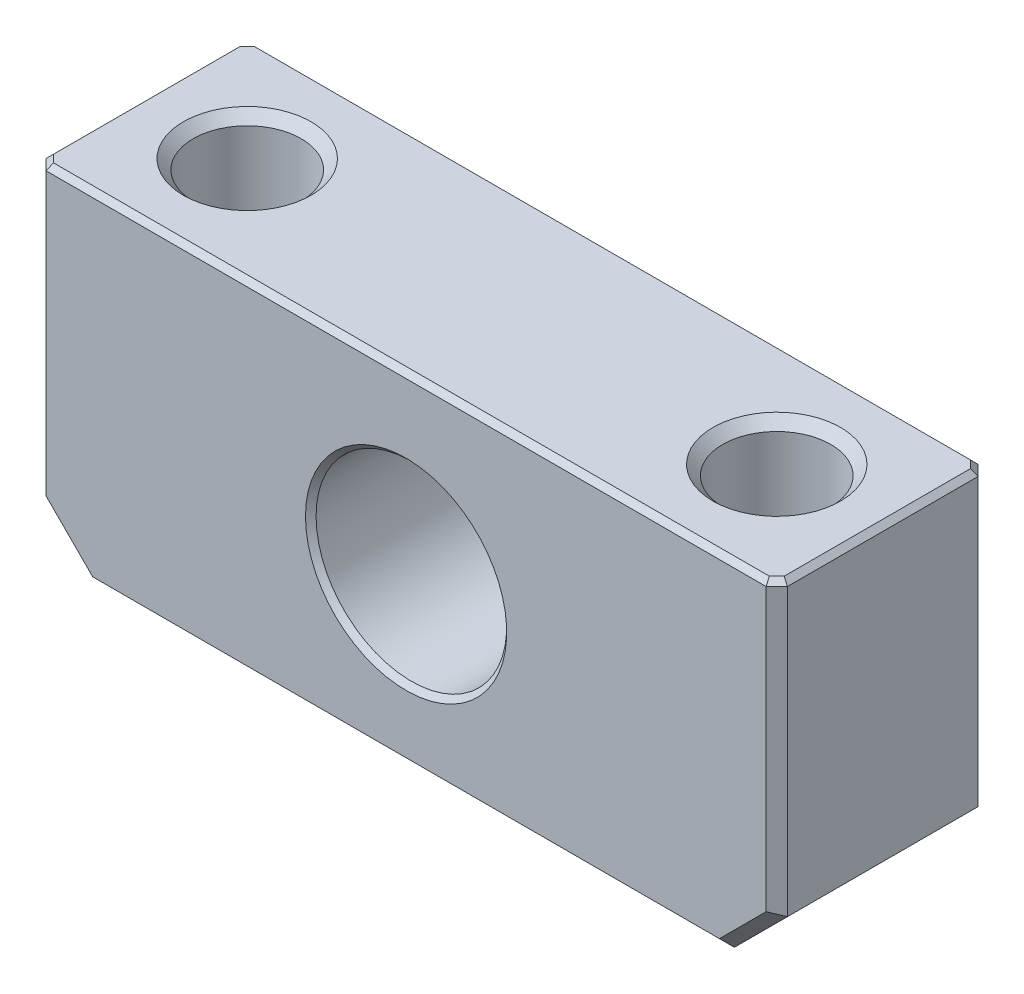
ISO-10303-21;
HEADER;
FILE_DESCRIPTION(('STEP AP214'),'2;1');
FILE_NAME('part.step','',(''),(''),'','','');
FILE_SCHEMA(('AUTOMOTIVE_DESIGN { 1 0 10303 214 1 1 1 1 }'));
ENDSEC;
DATA;
#1=APPLICATION_CONTEXT('core data for automotive mechanical design processes');
#2=APPLICATION_PROTOCOL_DEFINITION('international standard','automotive_design',2000,#1);
#3=PRODUCT_CONTEXT('',#1,'mechanical');
#4=PRODUCT('Part','Part','',(#3));
#5=PRODUCT_RELATED_PRODUCT_CATEGORY('part','',(#4));
#6=PRODUCT_DEFINITION_FORMATION('','',#4);
#7=PRODUCT_DEFINITION_CONTEXT('part definition',#1,'design');
#8=PRODUCT_DEFINITION('design','',#6,#7);
#9=PRODUCT_DEFINITION_SHAPE('','',#8);
#10=(LENGTH_UNIT() NAMED_UNIT(*) SI_UNIT(.MILLI.,.METRE.));
#11=(NAMED_UNIT(*) PLANE_ANGLE_UNIT() SI_UNIT($,.RADIAN.));
#12=(NAMED_UNIT(*) SI_UNIT($,.STERADIAN.) SOLID_ANGLE_UNIT());
#13=UNCERTAINTY_MEASURE_WITH_UNIT(LENGTH_MEASURE(1.E-05),#10,'distance_accuracy_value','');
#14=(GEOMETRIC_REPRESENTATION_CONTEXT(3) GLOBAL_UNCERTAINTY_ASSIGNED_CONTEXT((#13)) GLOBAL_UNIT_ASSIGNED_CONTEXT((#10,
#11,#12)) REPRESENTATION_CONTEXT('',''));
#15=CARTESIAN_POINT('',(0.,0.,0.));
#16=DIRECTION('',(0.,0.,1.));
#17=DIRECTION('',(1.,0.,0.));
#18=AXIS2_PLACEMENT_3D('',#15,#16,#17);
#19=CARTESIAN_POINT('',(-35.,16.5,-10.));
#20=DIRECTION('',(0.,1.,0.));
#21=DIRECTION('',(0.,0.,1.));
#22=AXIS2_PLACEMENT_3D('',#19,#20,#21);
#23=PLANE('',#22);
#24=DIRECTION('',(1.,0.,0.));
#25=VECTOR('',#24,1.);
#26=CARTESIAN_POINT('',(34.,16.5,9.5));
#27=LINE('',#26,#25);
#28=CARTESIAN_POINT('',(-33.7928932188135,16.5,9.5));
#29=VERTEX_POINT('',#28);
#30=CARTESIAN_POINT('',(33.7928932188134,16.5,9.5));
#31=VERTEX_POINT('',#30);
#32=EDGE_CURVE('E275',#29,#31,#27,.T.);
#33=ORIENTED_EDGE('',*,*,#32,.T.);
#34=DIRECTION('',(0.707106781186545,0.,-0.70710678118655));
#35=VECTOR('',#34,1.);
#36=CARTESIAN_POINT('',(9.14644660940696,16.5,34.1464466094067));
#37=LINE('',#36,#35);
#38=CARTESIAN_POINT('',(34.5,16.5,8.79289321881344));
#39=VERTEX_POINT('',#38);
#40=EDGE_CURVE('E289',#31,#39,#37,.T.);
#41=ORIENTED_EDGE('',*,*,#40,.T.);
#42=DIRECTION('',(0.,0.,-1.));
#43=VECTOR('',#42,1.);
#44=CARTESIAN_POINT('',(34.5,16.5,-10.));
#45=LINE('',#44,#43);
#46=CARTESIAN_POINT('',(34.5,16.5,-8.79289321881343));
#47=VERTEX_POINT('',#46);
#48=EDGE_CURVE('E287',#39,#47,#45,.T.);
#49=ORIENTED_EDGE('',*,*,#48,.T.);
#50=DIRECTION('',(-0.70710678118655,0.,-0.707106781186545));
#51=VECTOR('',#50,1.);
#52=CARTESIAN_POINT('',(-0.853553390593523,16.5,-44.1464466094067));
#53=LINE('',#52,#51);
#54=CARTESIAN_POINT('',(33.7928932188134,16.5,-9.5));
#55=VERTEX_POINT('',#54);
#56=EDGE_CURVE('E285',#47,#55,#53,.T.);
#57=ORIENTED_EDGE('',*,*,#56,.T.);
#58=DIRECTION('',(-1.,0.,0.));
#59=VECTOR('',#58,1.);
#60=CARTESIAN_POINT('',(-35.,16.5,-9.5));
#61=LINE('',#60,#59);
#62=CARTESIAN_POINT('',(-33.7928932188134,16.5,-9.5));
#63=VERTEX_POINT('',#62);
#64=EDGE_CURVE('E283',#55,#63,#61,.T.);
#65=ORIENTED_EDGE('',*,*,#64,.T.);
#66=DIRECTION('',(-0.70710678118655,0.,0.707106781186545));
#67=VECTOR('',#66,1.);
#68=CARTESIAN_POINT('',(-34.1464466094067,16.5,-9.14644660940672));
#69=LINE('',#68,#67);
#70=CARTESIAN_POINT('',(-34.5,16.5,-8.79289321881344));
#71=VERTEX_POINT('',#70);
#72=EDGE_CURVE('E281',#63,#71,#69,.T.);
#73=ORIENTED_EDGE('',*,*,#72,.T.);
#74=DIRECTION('',(0.,0.,1.));
#75=VECTOR('',#74,1.);
#76=CARTESIAN_POINT('',(-34.5,16.5,-10.));
#77=LINE('',#76,#75);
#78=CARTESIAN_POINT('',(-34.5,16.5,8.79289321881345));
#79=VERTEX_POINT('',#78);
#80=EDGE_CURVE('E279',#71,#79,#77,.T.);
#81=ORIENTED_EDGE('',*,*,#80,.T.);
#82=DIRECTION('',(0.707106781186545,0.,0.70710678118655));
#83=VECTOR('',#82,1.);
#84=CARTESIAN_POINT('',(-44.1464466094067,16.5,-0.853553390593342));
#85=LINE('',#84,#83);
#86=EDGE_CURVE('E277',#79,#29,#85,.T.);
#87=ORIENTED_EDGE('',*,*,#86,.T.);
#88=EDGE_LOOP('',(#33,#41,#49,#57,#65,#73,#81,#87));
#89=FACE_BOUND('',#88,.T.);
#90=CARTESIAN_POINT('',(-25.,16.5,0.));
#91=DIRECTION('',(0.,1.,0.));
#92=DIRECTION('',(0.,0.,1.));
#93=AXIS2_PLACEMENT_3D('',#90,#91,#92);
#94=CIRCLE('',#93,6.025);
#95=CARTESIAN_POINT('',(-25.,16.5,6.025));
#96=VERTEX_POINT('',#95);
#97=EDGE_CURVE('E171',#96,#96,#94,.T.);
#98=ORIENTED_EDGE('',*,*,#97,.F.);
#99=EDGE_LOOP('',(#98));
#100=FACE_BOUND('',#99,.T.);
#101=CARTESIAN_POINT('',(25.,16.5,0.));
#102=DIRECTION('',(0.,1.,0.));
#103=DIRECTION('',(0.,0.,1.));
#104=AXIS2_PLACEMENT_3D('',#101,#102,#103);
#105=CIRCLE('',#104,6.025);
#106=CARTESIAN_POINT('',(25.,16.5,6.025));
#107=VERTEX_POINT('',#106);
#108=EDGE_CURVE('E164',#107,#107,#105,.T.);
#109=ORIENTED_EDGE('',*,*,#108,.F.);
#110=EDGE_LOOP('',(#109));
#111=FACE_BOUND('',#110,.T.);
#112=ADVANCED_FACE('F36',(#89,#100,#111),#23,.T.);
#113=CARTESIAN_POINT('',(35.,16.5,-10.));
#114=DIRECTION('',(1.,0.,0.));
#115=DIRECTION('',(0.,0.,-1.));
#116=AXIS2_PLACEMENT_3D('',#113,#114,#115);
#117=PLANE('',#116);
#118=DIRECTION('',(0.,1.,0.));
#119=VECTOR('',#118,1.);
#120=CARTESIAN_POINT('',(35.,16.5,-8.99999999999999));
#121=LINE('',#120,#119);
#122=CARTESIAN_POINT('',(35.,-11.,-8.99999999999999));
#123=VERTEX_POINT('',#122);
#124=CARTESIAN_POINT('',(35.,16.,-8.99999999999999));
#125=VERTEX_POINT('',#124);
#126=EDGE_CURVE('E203',#123,#125,#121,.T.);
#127=ORIENTED_EDGE('',*,*,#126,.T.);
#128=DIRECTION('',(0.,0.,1.));
#129=VECTOR('',#128,1.);
#130=CARTESIAN_POINT('',(35.,16.,-10.));
#131=LINE('',#130,#129);
#132=CARTESIAN_POINT('',(35.,16.,8.99999999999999));
#133=VERTEX_POINT('',#132);
#134=EDGE_CURVE('E295',#125,#133,#131,.T.);
#135=ORIENTED_EDGE('',*,*,#134,.T.);
#136=DIRECTION('',(0.,-1.,0.));
#137=VECTOR('',#136,1.);
#138=CARTESIAN_POINT('',(35.,-11.,8.99999999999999));
#139=LINE('',#138,#137);
#140=CARTESIAN_POINT('',(35.,-11.,8.99999999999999));
#141=VERTEX_POINT('',#140);
#142=EDGE_CURVE('E206',#133,#141,#139,.T.);
#143=ORIENTED_EDGE('',*,*,#142,.T.);
#144=DIRECTION('',(0.,0.,-1.));
#145=VECTOR('',#144,1.);
#146=CARTESIAN_POINT('',(35.,-11.,-10.));
#147=LINE('',#146,#145);
#148=EDGE_CURVE('E189',#141,#123,#147,.T.);
#149=ORIENTED_EDGE('',*,*,#148,.T.);
#150=EDGE_LOOP('',(#127,#135,#143,#149));
#151=FACE_BOUND('',#150,.T.);
#152=ADVANCED_FACE('F395',(#151),#117,.T.);
#153=CARTESIAN_POINT('',(-35.,-16.,-10.));
#154=DIRECTION('',(0.,-1.,0.));
#155=DIRECTION('',(0.,0.,-1.));
#156=AXIS2_PLACEMENT_3D('',#153,#154,#155);
#157=PLANE('',#156);
#158=DIRECTION('',(0.,0.,1.));
#159=VECTOR('',#158,1.);
#160=CARTESIAN_POINT('',(30.,-16.,-10.));
#161=LINE('',#160,#159);
#162=CARTESIAN_POINT('',(30.,-16.,-8.99999999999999));
#163=VERTEX_POINT('',#162);
#164=CARTESIAN_POINT('',(30.,-16.,8.99999999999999));
#165=VERTEX_POINT('',#164);
#166=EDGE_CURVE('E183',#163,#165,#161,.T.);
#167=ORIENTED_EDGE('',*,*,#166,.T.);
#168=DIRECTION('',(-1.,0.,0.));
#169=VECTOR('',#168,1.);
#170=CARTESIAN_POINT('',(-30.,-16.,8.99999999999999));
#171=LINE('',#170,#169);
#172=CARTESIAN_POINT('',(-30.,-16.,8.99999999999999));
#173=VERTEX_POINT('',#172);
#174=EDGE_CURVE('E214',#165,#173,#171,.T.);
#175=ORIENTED_EDGE('',*,*,#174,.T.);
#176=DIRECTION('',(0.,0.,-1.));
#177=VECTOR('',#176,1.);
#178=CARTESIAN_POINT('',(-30.,-16.,-10.));
#179=LINE('',#178,#177);
#180=CARTESIAN_POINT('',(-30.,-16.,-8.99999999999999));
#181=VERTEX_POINT('',#180);
#182=EDGE_CURVE('E186',#173,#181,#179,.T.);
#183=ORIENTED_EDGE('',*,*,#182,.T.);
#184=DIRECTION('',(1.,0.,0.));
#185=VECTOR('',#184,1.);
#186=CARTESIAN_POINT('',(-35.,-16.,-8.99999999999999));
#187=LINE('',#186,#185);
#188=EDGE_CURVE('E212',#181,#163,#187,.T.);
#189=ORIENTED_EDGE('',*,*,#188,.T.);
#190=EDGE_LOOP('',(#167,#175,#183,#189));
#191=FACE_BOUND('',#190,.T.);
#192=ADVANCED_FACE('F352',(#191),#157,.T.);
#193=CARTESIAN_POINT('',(-35.,-16.,-10.));
#194=DIRECTION('',(-1.,0.,0.));
#195=DIRECTION('',(0.,0.,1.));
#196=AXIS2_PLACEMENT_3D('',#193,#194,#195);
#197=PLANE('',#196);
#198=DIRECTION('',(0.,1.,0.));
#199=VECTOR('',#198,1.);
#200=CARTESIAN_POINT('',(-35.,16.5,8.99999999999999));
#201=LINE('',#200,#199);
#202=CARTESIAN_POINT('',(-35.,-11.,8.99999999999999));
#203=VERTEX_POINT('',#202);
#204=CARTESIAN_POINT('',(-35.,16.,8.99999999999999));
#205=VERTEX_POINT('',#204);
#206=EDGE_CURVE('E222',#203,#205,#201,.T.);
#207=ORIENTED_EDGE('',*,*,#206,.T.);
#208=DIRECTION('',(0.,0.,-1.));
#209=VECTOR('',#208,1.);
#210=CARTESIAN_POINT('',(-35.,16.,-10.));
#211=LINE('',#210,#209);
#212=CARTESIAN_POINT('',(-35.,16.,-8.99999999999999));
#213=VERTEX_POINT('',#212);
#214=EDGE_CURVE('E45',#205,#213,#211,.T.);
#215=ORIENTED_EDGE('',*,*,#214,.T.);
#216=DIRECTION('',(0.,-1.,0.));
#217=VECTOR('',#216,1.);
#218=CARTESIAN_POINT('',(-35.,-16.,-8.99999999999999));
#219=LINE('',#218,#217);
#220=CARTESIAN_POINT('',(-35.,-11.,-8.99999999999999));
#221=VERTEX_POINT('',#220);
#222=EDGE_CURVE('E220',#213,#221,#219,.T.);
#223=ORIENTED_EDGE('',*,*,#222,.T.);
#224=DIRECTION('',(0.,0.,1.));
#225=VECTOR('',#224,1.);
#226=CARTESIAN_POINT('',(-35.,-11.,-10.));
#227=LINE('',#226,#225);
#228=EDGE_CURVE('E180',#221,#203,#227,.T.);
#229=ORIENTED_EDGE('',*,*,#228,.T.);
#230=EDGE_LOOP('',(#207,#215,#223,#229));
#231=FACE_BOUND('',#230,.T.);
#232=ADVANCED_FACE('F385',(#231),#197,.T.);
#233=CARTESIAN_POINT('',(35.,16.5,-10.));
#234=DIRECTION('',(0.,0.,-1.));
#235=DIRECTION('',(-1.,0.,0.));
#236=AXIS2_PLACEMENT_3D('',#233,#234,#235);
#237=PLANE('',#236);
#238=CARTESIAN_POINT('',(0.,0.,-10.));
#239=DIRECTION('',(0.,0.,-1.));
#240=DIRECTION('',(-1.,0.,0.));
#241=AXIS2_PLACEMENT_3D('',#238,#239,#240);
#242=CIRCLE('',#241,9.49999999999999);
#243=CARTESIAN_POINT('',(-9.49999999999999,0.,-10.));
#244=VERTEX_POINT('',#243);
#245=EDGE_CURVE('E272',#244,#244,#242,.F.);
#246=ORIENTED_EDGE('',*,*,#245,.T.);
#247=EDGE_LOOP('',(#246));
#248=FACE_BOUND('',#247,.T.);
#249=DIRECTION('',(0.,1.,0.));
#250=VECTOR('',#249,1.);
#251=CARTESIAN_POINT('',(-34.,16.5,-10.));
#252=LINE('',#251,#250);
#253=CARTESIAN_POINT('',(-34.,-10.5857864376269,-10.));
#254=VERTEX_POINT('',#253);
#255=CARTESIAN_POINT('',(-34.,16.,-10.));
#256=VERTEX_POINT('',#255);
#257=EDGE_CURVE('E224',#254,#256,#252,.T.);
#258=ORIENTED_EDGE('',*,*,#257,.T.);
#259=DIRECTION('',(1.,0.,0.));
#260=VECTOR('',#259,1.);
#261=CARTESIAN_POINT('',(35.,16.,-10.));
#262=LINE('',#261,#260);
#263=CARTESIAN_POINT('',(34.,16.,-10.));
#264=VERTEX_POINT('',#263);
#265=EDGE_CURVE('E270',#256,#264,#262,.T.);
#266=ORIENTED_EDGE('',*,*,#265,.T.);
#267=DIRECTION('',(0.,-1.,0.));
#268=VECTOR('',#267,1.);
#269=CARTESIAN_POINT('',(34.,16.5,-10.));
#270=LINE('',#269,#268);
#271=CARTESIAN_POINT('',(34.,-10.5857864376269,-10.));
#272=VERTEX_POINT('',#271);
#273=EDGE_CURVE('E233',#264,#272,#270,.T.);
#274=ORIENTED_EDGE('',*,*,#273,.T.);
#275=DIRECTION('',(-0.707106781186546,-0.707106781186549,0.));
#276=VECTOR('',#275,1.);
#277=CARTESIAN_POINT('',(48.0428932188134,3.45710678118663,-10.));
#278=LINE('',#277,#276);
#279=CARTESIAN_POINT('',(29.5857864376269,-15.,-10.));
#280=VERTEX_POINT('',#279);
#281=EDGE_CURVE('E231',#272,#280,#278,.T.);
#282=ORIENTED_EDGE('',*,*,#281,.T.);
#283=DIRECTION('',(-1.,0.,0.));
#284=VECTOR('',#283,1.);
#285=CARTESIAN_POINT('',(35.,-15.,-10.));
#286=LINE('',#285,#284);
#287=CARTESIAN_POINT('',(-29.5857864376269,-15.,-10.));
#288=VERTEX_POINT('',#287);
#289=EDGE_CURVE('E229',#280,#288,#286,.T.);
#290=ORIENTED_EDGE('',*,*,#289,.T.);
#291=DIRECTION('',(-0.707106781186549,0.707106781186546,0.));
#292=VECTOR('',#291,1.);
#293=CARTESIAN_POINT('',(-13.0428932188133,-31.5428932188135,-10.));
#294=LINE('',#293,#292);
#295=EDGE_CURVE('E227',#288,#254,#294,.T.);
#296=ORIENTED_EDGE('',*,*,#295,.T.);
#297=EDGE_LOOP('',(#258,#266,#274,#282,#290,#296));
#298=FACE_BOUND('',#297,.T.);
#299=ADVANCED_FACE('F337',(#248,#298),#237,.T.);
#300=CARTESIAN_POINT('',(0.,0.,-10.));
#301=DIRECTION('',(0.,0.,1.));
#302=DIRECTION('',(1.,0.,0.));
#303=AXIS2_PLACEMENT_3D('',#300,#301,#302);
#304=CYLINDRICAL_SURFACE('',#303,9.);
#305=CARTESIAN_POINT('',(0.,0.,9.5));
#306=DIRECTION('',(0.,0.,-1.));
#307=DIRECTION('',(-1.,0.,0.));
#308=AXIS2_PLACEMENT_3D('',#305,#306,#307);
#309=CIRCLE('',#308,9.);
#310=CARTESIAN_POINT('',(-9.,0.,9.5));
#311=VERTEX_POINT('',#310);
#312=EDGE_CURVE('E262',#311,#311,#309,.F.);
#313=ORIENTED_EDGE('',*,*,#312,.T.);
#314=EDGE_LOOP('',(#313));
#315=FACE_BOUND('',#314,.T.);
#316=CARTESIAN_POINT('',(0.,0.,-9.49999999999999));
#317=DIRECTION('',(0.,0.,-1.));
#318=DIRECTION('',(-1.,0.,0.));
#319=AXIS2_PLACEMENT_3D('',#316,#317,#318);
#320=CIRCLE('',#319,9.);
#321=CARTESIAN_POINT('',(-9.,0.,-9.49999999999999));
#322=VERTEX_POINT('',#321);
#323=EDGE_CURVE('E235',#322,#322,#320,.T.);
#324=ORIENTED_EDGE('',*,*,#323,.T.);
#325=EDGE_LOOP('',(#324));
#326=FACE_BOUND('',#325,.T.);
#327=ADVANCED_FACE('F392',(#315,#326),#304,.F.);
#328=CARTESIAN_POINT('',(35.,16.5,10.));
#329=DIRECTION('',(0.,0.,-1.));
#330=DIRECTION('',(-1.,0.,0.));
#331=AXIS2_PLACEMENT_3D('',#328,#329,#330);
#332=PLANE('',#331);
#333=CARTESIAN_POINT('',(0.,0.,10.));
#334=DIRECTION('',(0.,0.,-1.));
#335=DIRECTION('',(-1.,0.,0.));
#336=AXIS2_PLACEMENT_3D('',#333,#334,#335);
#337=CIRCLE('',#336,9.49999999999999);
#338=CARTESIAN_POINT('',(-9.49999999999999,0.,10.));
#339=VERTEX_POINT('',#338);
#340=EDGE_CURVE('E267',#339,#339,#337,.T.);
#341=ORIENTED_EDGE('',*,*,#340,.T.);
#342=EDGE_LOOP('',(#341));
#343=FACE_BOUND('',#342,.T.);
#344=DIRECTION('',(0.,1.,0.));
#345=VECTOR('',#344,1.);
#346=CARTESIAN_POINT('',(34.,16.5,10.));
#347=LINE('',#346,#345);
#348=CARTESIAN_POINT('',(34.,-10.5857864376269,10.));
#349=VERTEX_POINT('',#348);
#350=CARTESIAN_POINT('',(34.,16.,10.));
#351=VERTEX_POINT('',#350);
#352=EDGE_CURVE('E200',#349,#351,#347,.T.);
#353=ORIENTED_EDGE('',*,*,#352,.T.);
#354=DIRECTION('',(-1.,0.,0.));
#355=VECTOR('',#354,1.);
#356=CARTESIAN_POINT('',(-34.,16.,10.));
#357=LINE('',#356,#355);
#358=CARTESIAN_POINT('',(-34.,16.,10.));
#359=VERTEX_POINT('',#358);
#360=EDGE_CURVE('E265',#351,#359,#357,.T.);
#361=ORIENTED_EDGE('',*,*,#360,.T.);
#362=DIRECTION('',(0.,-1.,0.));
#363=VECTOR('',#362,1.);
#364=CARTESIAN_POINT('',(-34.,-11.,10.));
#365=LINE('',#364,#363);
#366=CARTESIAN_POINT('',(-34.,-10.5857864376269,10.));
#367=VERTEX_POINT('',#366);
#368=EDGE_CURVE('E192',#359,#367,#365,.T.);
#369=ORIENTED_EDGE('',*,*,#368,.T.);
#370=DIRECTION('',(0.707106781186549,-0.707106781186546,0.));
#371=VECTOR('',#370,1.);
#372=CARTESIAN_POINT('',(-29.2928932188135,-15.2928932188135,10.));
#373=LINE('',#372,#371);
#374=CARTESIAN_POINT('',(-29.5857864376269,-15.,10.));
#375=VERTEX_POINT('',#374);
#376=EDGE_CURVE('E194',#367,#375,#373,.T.);
#377=ORIENTED_EDGE('',*,*,#376,.T.);
#378=DIRECTION('',(1.,0.,0.));
#379=VECTOR('',#378,1.);
#380=CARTESIAN_POINT('',(30.,-15.,10.));
#381=LINE('',#380,#379);
#382=CARTESIAN_POINT('',(29.5857864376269,-15.,10.));
#383=VERTEX_POINT('',#382);
#384=EDGE_CURVE('E196',#375,#383,#381,.T.);
#385=ORIENTED_EDGE('',*,*,#384,.T.);
#386=DIRECTION('',(0.707106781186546,0.707106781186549,0.));
#387=VECTOR('',#386,1.);
#388=CARTESIAN_POINT('',(34.2928932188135,-10.2928932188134,10.));
#389=LINE('',#388,#387);
#390=EDGE_CURVE('E198',#383,#349,#389,.T.);
#391=ORIENTED_EDGE('',*,*,#390,.T.);
#392=EDGE_LOOP('',(#353,#361,#369,#377,#385,#391));
#393=FACE_BOUND('',#392,.T.);
#394=ADVANCED_FACE('F370',(#343,#393),#332,.F.);
#395=CARTESIAN_POINT('',(25.,-10.5,0.));
#396=DIRECTION('',(0.,1.,0.));
#397=DIRECTION('',(0.,0.,1.));
#398=AXIS2_PLACEMENT_3D('',#395,#396,#397);
#399=CONICAL_SURFACE('',#398,5.09999999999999,1.02974425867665);
#400=CARTESIAN_POINT('',(25.,-13.5643891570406,0.));
#401=VERTEX_POINT('',#400);
#402=VERTEX_LOOP('',#401);
#403=FACE_BOUND('',#402,.T.);
#404=CARTESIAN_POINT('',(25.,-10.5,0.));
#405=DIRECTION('',(0.,1.,0.));
#406=DIRECTION('',(0.,0.,1.));
#407=AXIS2_PLACEMENT_3D('',#404,#405,#406);
#408=CIRCLE('',#407,5.09999999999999);
#409=CARTESIAN_POINT('',(25.,-10.5,5.09999999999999));
#410=VERTEX_POINT('',#409);
#411=EDGE_CURVE('E177',#410,#410,#408,.T.);
#412=ORIENTED_EDGE('',*,*,#411,.T.);
#413=EDGE_LOOP('',(#412));
#414=FACE_BOUND('',#413,.T.);
#415=ADVANCED_FACE('F563',(#403,#414),#399,.F.);
#416=CARTESIAN_POINT('',(25.,16.5,0.));
#417=DIRECTION('',(0.,1.,0.));
#418=DIRECTION('',(0.,0.,1.));
#419=AXIS2_PLACEMENT_3D('',#416,#417,#418);
#420=CYLINDRICAL_SURFACE('',#419,5.1);
#421=ORIENTED_EDGE('',*,*,#411,.F.);
#422=EDGE_LOOP('',(#421));
#423=FACE_BOUND('',#422,.T.);
#424=CARTESIAN_POINT('',(25.,15.575,0.));
#425=DIRECTION('',(0.,1.,0.));
#426=DIRECTION('',(0.,0.,1.));
#427=AXIS2_PLACEMENT_3D('',#424,#425,#426);
#428=CIRCLE('',#427,5.1);
#429=CARTESIAN_POINT('',(25.,15.575,5.1));
#430=VERTEX_POINT('',#429);
#431=EDGE_CURVE('E168',#430,#430,#428,.T.);
#432=ORIENTED_EDGE('',*,*,#431,.T.);
#433=EDGE_LOOP('',(#432));
#434=FACE_BOUND('',#433,.T.);
#435=ADVANCED_FACE('F555',(#423,#434),#420,.F.);
#436=CARTESIAN_POINT('',(25.,16.5,0.));
#437=DIRECTION('',(0.,1.,0.));
#438=DIRECTION('',(0.,0.,1.));
#439=AXIS2_PLACEMENT_3D('',#436,#437,#438);
#440=CONICAL_SURFACE('',#439,6.025,0.785398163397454);
#441=ORIENTED_EDGE('',*,*,#431,.F.);
#442=EDGE_LOOP('',(#441));
#443=FACE_BOUND('',#442,.T.);
#444=ORIENTED_EDGE('',*,*,#108,.T.);
#445=EDGE_LOOP('',(#444));
#446=FACE_BOUND('',#445,.T.);
#447=ADVANCED_FACE('F158',(#443,#446),#440,.F.);
#448=CARTESIAN_POINT('',(-25.,-10.5,0.));
#449=DIRECTION('',(0.,1.,0.));
#450=DIRECTION('',(0.,0.,1.));
#451=AXIS2_PLACEMENT_3D('',#448,#449,#450);
#452=CONICAL_SURFACE('',#451,5.09999999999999,1.02974425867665);
#453=CARTESIAN_POINT('',(-25.,-13.5643891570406,0.));
#454=VERTEX_POINT('',#453);
#455=VERTEX_LOOP('',#454);
#456=FACE_BOUND('',#455,.T.);
#457=CARTESIAN_POINT('',(-25.,-10.5,0.));
#458=DIRECTION('',(0.,1.,0.));
#459=DIRECTION('',(0.,0.,1.));
#460=AXIS2_PLACEMENT_3D('',#457,#458,#459);
#461=CIRCLE('',#460,5.09999999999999);
#462=CARTESIAN_POINT('',(-25.,-10.5,5.09999999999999));
#463=VERTEX_POINT('',#462);
#464=EDGE_CURVE('E162',#463,#463,#461,.T.);
#465=ORIENTED_EDGE('',*,*,#464,.T.);
#466=EDGE_LOOP('',(#465));
#467=FACE_BOUND('',#466,.T.);
#468=ADVANCED_FACE('F154',(#456,#467),#452,.F.);
#469=CARTESIAN_POINT('',(-25.,16.5,0.));
#470=DIRECTION('',(0.,1.,0.));
#471=DIRECTION('',(0.,0.,1.));
#472=AXIS2_PLACEMENT_3D('',#469,#470,#471);
#473=CYLINDRICAL_SURFACE('',#472,5.1);
#474=ORIENTED_EDGE('',*,*,#464,.F.);
#475=EDGE_LOOP('',(#474));
#476=FACE_BOUND('',#475,.T.);
#477=CARTESIAN_POINT('',(-25.,15.575,0.));
#478=DIRECTION('',(0.,1.,0.));
#479=DIRECTION('',(0.,0.,1.));
#480=AXIS2_PLACEMENT_3D('',#477,#478,#479);
#481=CIRCLE('',#480,5.1);
#482=CARTESIAN_POINT('',(-25.,15.575,5.1));
#483=VERTEX_POINT('',#482);
#484=EDGE_CURVE('E165',#483,#483,#481,.T.);
#485=ORIENTED_EDGE('',*,*,#484,.T.);
#486=EDGE_LOOP('',(#485));
#487=FACE_BOUND('',#486,.T.);
#488=ADVANCED_FACE('F157',(#476,#487),#473,.F.);
#489=CARTESIAN_POINT('',(-25.,16.5,0.));
#490=DIRECTION('',(0.,1.,0.));
#491=DIRECTION('',(0.,0.,1.));
#492=AXIS2_PLACEMENT_3D('',#489,#490,#491);
#493=CONICAL_SURFACE('',#492,6.025,0.785398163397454);
#494=ORIENTED_EDGE('',*,*,#484,.F.);
#495=EDGE_LOOP('',(#494));
#496=FACE_BOUND('',#495,.T.);
#497=ORIENTED_EDGE('',*,*,#97,.T.);
#498=EDGE_LOOP('',(#497));
#499=FACE_BOUND('',#498,.T.);
#500=ADVANCED_FACE('F409',(#496,#499),#493,.F.);
#501=CARTESIAN_POINT('',(-35.,-11.,-10.));
#502=DIRECTION('',(0.707106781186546,0.707106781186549,0.));
#503=DIRECTION('',(-0.707106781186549,0.707106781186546,0.));
#504=AXIS2_PLACEMENT_3D('',#501,#502,#503);
#505=PLANE('',#504);
#506=ORIENTED_EDGE('',*,*,#182,.F.);
#507=DIRECTION('',(0.707106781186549,-0.707106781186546,0.));
#508=VECTOR('',#507,1.);
#509=CARTESIAN_POINT('',(-35.,-11.,8.99999999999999));
#510=LINE('',#509,#508);
#511=EDGE_CURVE('E218',#173,#203,#510,.F.);
#512=ORIENTED_EDGE('',*,*,#511,.T.);
#513=ORIENTED_EDGE('',*,*,#228,.F.);
#514=DIRECTION('',(-0.707106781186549,0.707106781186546,0.));
#515=VECTOR('',#514,1.);
#516=CARTESIAN_POINT('',(-35.,-11.,-8.99999999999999));
#517=LINE('',#516,#515);
#518=EDGE_CURVE('E216',#221,#181,#517,.F.);
#519=ORIENTED_EDGE('',*,*,#518,.T.);
#520=EDGE_LOOP('',(#506,#512,#513,#519));
#521=FACE_BOUND('',#520,.T.);
#522=ADVANCED_FACE('F379',(#521),#505,.F.);
#523=CARTESIAN_POINT('',(30.,-16.,-10.));
#524=DIRECTION('',(-0.707106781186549,0.707106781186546,0.));
#525=DIRECTION('',(-0.707106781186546,-0.707106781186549,0.));
#526=AXIS2_PLACEMENT_3D('',#523,#524,#525);
#527=PLANE('',#526);
#528=ORIENTED_EDGE('',*,*,#148,.F.);
#529=DIRECTION('',(0.707106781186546,0.707106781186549,0.));
#530=VECTOR('',#529,1.);
#531=CARTESIAN_POINT('',(30.,-16.,8.99999999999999));
#532=LINE('',#531,#530);
#533=EDGE_CURVE('E210',#141,#165,#532,.F.);
#534=ORIENTED_EDGE('',*,*,#533,.T.);
#535=ORIENTED_EDGE('',*,*,#166,.F.);
#536=DIRECTION('',(-0.707106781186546,-0.707106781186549,0.));
#537=VECTOR('',#536,1.);
#538=CARTESIAN_POINT('',(30.,-16.,-8.99999999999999));
#539=LINE('',#538,#537);
#540=EDGE_CURVE('E208',#163,#123,#539,.F.);
#541=ORIENTED_EDGE('',*,*,#540,.T.);
#542=EDGE_LOOP('',(#528,#534,#535,#541));
#543=FACE_BOUND('',#542,.T.);
#544=ADVANCED_FACE('F357',(#543),#527,.F.);
#545=CARTESIAN_POINT('',(-34.,16.5,10.));
#546=DIRECTION('',(-0.70710678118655,0.,0.707106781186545));
#547=DIRECTION('',(0.707106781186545,0.,0.70710678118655));
#548=AXIS2_PLACEMENT_3D('',#545,#546,#547);
#549=PLANE('',#548);
#550=ORIENTED_EDGE('',*,*,#368,.F.);
#551=DIRECTION('',(-0.707106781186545,0.,-0.70710678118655));
#552=VECTOR('',#551,1.);
#553=CARTESIAN_POINT('',(-34.,16.,10.));
#554=LINE('',#553,#552);
#555=EDGE_CURVE('E11',#359,#205,#554,.T.);
#556=ORIENTED_EDGE('',*,*,#555,.T.);
#557=ORIENTED_EDGE('',*,*,#206,.F.);
#558=DIRECTION('',(-0.678598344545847,-0.281084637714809,-0.678598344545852));
#559=VECTOR('',#558,1.);
#560=CARTESIAN_POINT('',(-28.8335604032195,-8.44577708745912,15.1664395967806));
#561=LINE('',#560,#559);
#562=EDGE_CURVE('E246',#367,#203,#561,.T.);
#563=ORIENTED_EDGE('',*,*,#562,.F.);
#564=EDGE_LOOP('',(#550,#556,#557,#563));
#565=FACE_BOUND('',#564,.T.);
#566=ADVANCED_FACE('F384',(#565),#549,.T.);
#567=CARTESIAN_POINT('',(-13.0428932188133,-31.5428932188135,10.));
#568=DIRECTION('',(0.500000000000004,0.500000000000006,-0.707106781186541));
#569=DIRECTION('',(0.,0.81649658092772,0.577350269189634));
#570=AXIS2_PLACEMENT_3D('',#567,#568,#569);
#571=PLANE('',#570);
#572=ORIENTED_EDGE('',*,*,#562,.T.);
#573=ORIENTED_EDGE('',*,*,#511,.F.);
#574=DIRECTION('',(-0.281084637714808,-0.678598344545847,-0.678598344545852));
#575=VECTOR('',#574,1.);
#576=CARTESIAN_POINT('',(-31.4342065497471,-19.462480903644,5.53751909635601));
#577=LINE('',#576,#575);
#578=EDGE_CURVE('E243',#375,#173,#577,.T.);
#579=ORIENTED_EDGE('',*,*,#578,.F.);
#580=ORIENTED_EDGE('',*,*,#376,.F.);
#581=EDGE_LOOP('',(#572,#573,#579,#580));
#582=FACE_BOUND('',#581,.T.);
#583=ADVANCED_FACE('F382',(#582),#571,.F.);
#584=CARTESIAN_POINT('',(35.,-15.,10.));
#585=DIRECTION('',(0.,-0.70710678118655,0.707106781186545));
#586=DIRECTION('',(0.,-0.707106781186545,-0.70710678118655));
#587=AXIS2_PLACEMENT_3D('',#584,#585,#586);
#588=PLANE('',#587);
#589=ORIENTED_EDGE('',*,*,#578,.T.);
#590=ORIENTED_EDGE('',*,*,#174,.F.);
#591=DIRECTION('',(0.281084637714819,-0.678598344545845,-0.67859834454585));
#592=VECTOR('',#591,1.);
#593=CARTESIAN_POINT('',(30.0135557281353,-16.032726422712,8.967273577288));
#594=LINE('',#593,#592);
#595=EDGE_CURVE('E239',#383,#165,#594,.T.);
#596=ORIENTED_EDGE('',*,*,#595,.F.);
#597=ORIENTED_EDGE('',*,*,#384,.F.);
#598=EDGE_LOOP('',(#589,#590,#596,#597));
#599=FACE_BOUND('',#598,.T.);
#600=ADVANCED_FACE('F376',(#599),#588,.T.);
#601=CARTESIAN_POINT('',(48.0428932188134,3.45710678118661,10.));
#602=DIRECTION('',(-0.500000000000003,0.500000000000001,-0.707106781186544));
#603=DIRECTION('',(-0.816496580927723,0.,0.57735026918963));
#604=AXIS2_PLACEMENT_3D('',#601,#602,#603);
#605=PLANE('',#604);
#606=ORIENTED_EDGE('',*,*,#595,.T.);
#607=ORIENTED_EDGE('',*,*,#533,.F.);
#608=DIRECTION('',(0.678598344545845,-0.281084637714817,-0.67859834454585));
#609=VECTOR('',#608,1.);
#610=CARTESIAN_POINT('',(37.7881005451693,-12.1548690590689,6.21189945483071));
#611=LINE('',#610,#609);
#612=EDGE_CURVE('E236',#349,#141,#611,.T.);
#613=ORIENTED_EDGE('',*,*,#612,.F.);
#614=ORIENTED_EDGE('',*,*,#390,.F.);
#615=EDGE_LOOP('',(#606,#607,#613,#614));
#616=FACE_BOUND('',#615,.T.);
#617=ADVANCED_FACE('F361',(#616),#605,.F.);
#618=CARTESIAN_POINT('',(34.,16.5,10.));
#619=DIRECTION('',(0.70710678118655,0.,0.707106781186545));
#620=DIRECTION('',(0.707106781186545,0.,-0.70710678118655));
#621=AXIS2_PLACEMENT_3D('',#618,#619,#620);
#622=PLANE('',#621);
#623=ORIENTED_EDGE('',*,*,#142,.F.);
#624=DIRECTION('',(-0.707106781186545,0.,0.70710678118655));
#625=VECTOR('',#624,1.);
#626=CARTESIAN_POINT('',(34.,16.,10.));
#627=LINE('',#626,#625);
#628=EDGE_CURVE('E292',#133,#351,#627,.T.);
#629=ORIENTED_EDGE('',*,*,#628,.T.);
#630=ORIENTED_EDGE('',*,*,#352,.F.);
#631=ORIENTED_EDGE('',*,*,#612,.T.);
#632=EDGE_LOOP('',(#623,#629,#630,#631));
#633=FACE_BOUND('',#632,.T.);
#634=ADVANCED_FACE('F367',(#633),#622,.T.);
#635=CARTESIAN_POINT('',(-35.,-16.,-8.99999999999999));
#636=DIRECTION('',(0.707106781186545,0.,0.70710678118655));
#637=DIRECTION('',(0.70710678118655,0.,-0.707106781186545));
#638=AXIS2_PLACEMENT_3D('',#635,#636,#637);
#639=PLANE('',#638);
#640=ORIENTED_EDGE('',*,*,#222,.F.);
#641=DIRECTION('',(-0.70710678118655,0.,0.707106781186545));
#642=VECTOR('',#641,1.);
#643=CARTESIAN_POINT('',(-35.,16.,-8.99999999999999));
#644=LINE('',#643,#642);
#645=EDGE_CURVE('E299',#213,#256,#644,.F.);
#646=ORIENTED_EDGE('',*,*,#645,.T.);
#647=ORIENTED_EDGE('',*,*,#257,.F.);
#648=DIRECTION('',(0.678598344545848,0.281084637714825,-0.678598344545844));
#649=VECTOR('',#648,1.);
#650=CARTESIAN_POINT('',(-35.9537178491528,-11.3950428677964,-8.04628215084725));
#651=LINE('',#650,#649);
#652=EDGE_CURVE('E240',#221,#254,#651,.T.);
#653=ORIENTED_EDGE('',*,*,#652,.F.);
#654=EDGE_LOOP('',(#640,#646,#647,#653));
#655=FACE_BOUND('',#654,.T.);
#656=ADVANCED_FACE('F334',(#655),#639,.F.);
#657=CARTESIAN_POINT('',(-13.0428932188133,-31.5428932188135,-10.));
#658=DIRECTION('',(-0.499999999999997,-0.499999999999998,-0.707106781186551));
#659=DIRECTION('',(0.,0.816496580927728,-0.577350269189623));
#660=AXIS2_PLACEMENT_3D('',#657,#658,#659);
#661=PLANE('',#660);
#662=ORIENTED_EDGE('',*,*,#652,.T.);
#663=ORIENTED_EDGE('',*,*,#295,.F.);
#664=DIRECTION('',(0.281084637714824,0.678598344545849,-0.678598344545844));
#665=VECTOR('',#664,1.);
#666=CARTESIAN_POINT('',(-31.4342065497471,-19.4624809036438,-5.53751909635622));
#667=LINE('',#666,#665);
#668=EDGE_CURVE('E255',#181,#288,#667,.T.);
#669=ORIENTED_EDGE('',*,*,#668,.F.);
#670=ORIENTED_EDGE('',*,*,#518,.F.);
#671=EDGE_LOOP('',(#662,#663,#669,#670));
#672=FACE_BOUND('',#671,.T.);
#673=ADVANCED_FACE('F343',(#672),#661,.T.);
#674=CARTESIAN_POINT('',(-35.,-16.,-8.99999999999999));
#675=DIRECTION('',(0.,0.707106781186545,0.70710678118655));
#676=DIRECTION('',(0.,-0.70710678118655,0.707106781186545));
#677=AXIS2_PLACEMENT_3D('',#674,#675,#676);
#678=PLANE('',#677);
#679=ORIENTED_EDGE('',*,*,#668,.T.);
#680=ORIENTED_EDGE('',*,*,#289,.F.);
#681=DIRECTION('',(-0.281084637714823,0.678598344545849,-0.678598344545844));
#682=VECTOR('',#681,1.);
#683=CARTESIAN_POINT('',(24.8644427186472,-3.60166796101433,-21.3983320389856));
#684=LINE('',#683,#682);
#685=EDGE_CURVE('E252',#163,#280,#684,.T.);
#686=ORIENTED_EDGE('',*,*,#685,.F.);
#687=ORIENTED_EDGE('',*,*,#188,.F.);
#688=EDGE_LOOP('',(#679,#680,#686,#687));
#689=FACE_BOUND('',#688,.T.);
#690=ADVANCED_FACE('F347',(#689),#678,.F.);
#691=CARTESIAN_POINT('',(48.0428932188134,3.45710678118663,-10.));
#692=DIRECTION('',(0.499999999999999,-0.499999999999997,-0.707106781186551));
#693=DIRECTION('',(-0.816496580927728,0.,-0.577350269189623));
#694=AXIS2_PLACEMENT_3D('',#691,#692,#693);
#695=PLANE('',#694);
#696=ORIENTED_EDGE('',*,*,#685,.T.);
#697=ORIENTED_EDGE('',*,*,#281,.F.);
#698=DIRECTION('',(-0.678598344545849,0.281084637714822,-0.678598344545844));
#699=VECTOR('',#698,1.);
#700=CARTESIAN_POINT('',(37.7881005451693,-12.1548690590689,-6.21189945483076));
#701=LINE('',#700,#699);
#702=EDGE_CURVE('E249',#123,#272,#701,.T.);
#703=ORIENTED_EDGE('',*,*,#702,.F.);
#704=ORIENTED_EDGE('',*,*,#540,.F.);
#705=EDGE_LOOP('',(#696,#697,#703,#704));
#706=FACE_BOUND('',#705,.T.);
#707=ADVANCED_FACE('F426',(#706),#695,.T.);
#708=CARTESIAN_POINT('',(35.,16.5,-8.99999999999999));
#709=DIRECTION('',(-0.707106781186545,0.,0.70710678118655));
#710=DIRECTION('',(0.70710678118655,0.,0.707106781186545));
#711=AXIS2_PLACEMENT_3D('',#708,#709,#710);
#712=PLANE('',#711);
#713=ORIENTED_EDGE('',*,*,#273,.F.);
#714=DIRECTION('',(-0.70710678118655,0.,-0.707106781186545));
#715=VECTOR('',#714,1.);
#716=CARTESIAN_POINT('',(35.,16.,-8.99999999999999));
#717=LINE('',#716,#715);
#718=EDGE_CURVE('E297',#264,#125,#717,.F.);
#719=ORIENTED_EDGE('',*,*,#718,.T.);
#720=ORIENTED_EDGE('',*,*,#126,.F.);
#721=ORIENTED_EDGE('',*,*,#702,.T.);
#722=EDGE_LOOP('',(#713,#719,#720,#721));
#723=FACE_BOUND('',#722,.T.);
#724=ADVANCED_FACE('F422',(#723),#712,.F.);
#725=CARTESIAN_POINT('',(0.,0.,9.5));
#726=DIRECTION('',(0.,0.,1.));
#727=DIRECTION('',(1.,0.,0.));
#728=AXIS2_PLACEMENT_3D('',#725,#726,#727);
#729=CONICAL_SURFACE('',#728,9.,0.785398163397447);
#730=ORIENTED_EDGE('',*,*,#340,.F.);
#731=EDGE_LOOP('',(#730));
#732=FACE_BOUND('',#731,.T.);
#733=ORIENTED_EDGE('',*,*,#312,.F.);
#734=EDGE_LOOP('',(#733));
#735=FACE_BOUND('',#734,.T.);
#736=ADVANCED_FACE('F425',(#732,#735),#729,.F.);
#737=CARTESIAN_POINT('',(0.,0.,-10.));
#738=DIRECTION('',(0.,0.,-1.));
#739=DIRECTION('',(-1.,0.,0.));
#740=AXIS2_PLACEMENT_3D('',#737,#738,#739);
#741=CONICAL_SURFACE('',#740,9.49999999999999,0.785398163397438);
#742=ORIENTED_EDGE('',*,*,#323,.F.);
#743=EDGE_LOOP('',(#742));
#744=FACE_BOUND('',#743,.T.);
#745=ORIENTED_EDGE('',*,*,#245,.F.);
#746=EDGE_LOOP('',(#745));
#747=FACE_BOUND('',#746,.T.);
#748=ADVANCED_FACE('F439',(#744,#747),#741,.F.);
#749=CARTESIAN_POINT('',(-34.1464466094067,16.5,-9.14644660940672));
#750=DIRECTION('',(-0.499999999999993,0.707106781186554,-0.499999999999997));
#751=DIRECTION('',(0.,0.57735026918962,0.81649658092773));
#752=AXIS2_PLACEMENT_3D('',#749,#750,#751);
#753=PLANE('',#752);
#754=DIRECTION('',(0.281084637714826,0.678598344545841,0.678598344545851));
#755=VECTOR('',#754,1.);
#756=CARTESIAN_POINT('',(-33.7533889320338,16.5953717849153,-9.40462821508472));
#757=LINE('',#756,#755);
#758=EDGE_CURVE('E317',#256,#63,#757,.T.);
#759=ORIENTED_EDGE('',*,*,#758,.F.);
#760=ORIENTED_EDGE('',*,*,#645,.F.);
#761=DIRECTION('',(0.67859834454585,0.678598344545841,0.281084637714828));
#762=VECTOR('',#761,1.);
#763=CARTESIAN_POINT('',(-34.7302478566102,16.2697521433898,-8.88826500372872));
#764=LINE('',#763,#762);
#765=EDGE_CURVE('E40',#71,#213,#764,.F.);
#766=ORIENTED_EDGE('',*,*,#765,.F.);
#767=ORIENTED_EDGE('',*,*,#72,.F.);
#768=EDGE_LOOP('',(#759,#760,#766,#767));
#769=FACE_BOUND('',#768,.T.);
#770=ADVANCED_FACE('F38',(#769),#753,.T.);
#771=CARTESIAN_POINT('',(-34.5,16.5,-10.));
#772=DIRECTION('',(0.707106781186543,-0.707106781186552,0.));
#773=DIRECTION('',(0.707106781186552,0.707106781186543,0.));
#774=AXIS2_PLACEMENT_3D('',#771,#772,#773);
#775=PLANE('',#774);
#776=ORIENTED_EDGE('',*,*,#765,.T.);
#777=ORIENTED_EDGE('',*,*,#214,.F.);
#778=DIRECTION('',(-0.678598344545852,-0.678598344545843,0.281084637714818));
#779=VECTOR('',#778,1.);
#780=CARTESIAN_POINT('',(-37.102149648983,13.8978503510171,9.87073889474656));
#781=LINE('',#780,#779);
#782=EDGE_CURVE('E315',#79,#205,#781,.T.);
#783=ORIENTED_EDGE('',*,*,#782,.F.);
#784=ORIENTED_EDGE('',*,*,#80,.F.);
#785=EDGE_LOOP('',(#776,#777,#783,#784));
#786=FACE_BOUND('',#785,.T.);
#787=ADVANCED_FACE('F327',(#786),#775,.F.);
#788=CARTESIAN_POINT('',(-35.,16.5,-9.5));
#789=DIRECTION('',(0.,-0.707106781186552,0.707106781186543));
#790=DIRECTION('',(0.,-0.707106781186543,-0.707106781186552));
#791=AXIS2_PLACEMENT_3D('',#788,#789,#790);
#792=PLANE('',#791);
#793=ORIENTED_EDGE('',*,*,#758,.T.);
#794=ORIENTED_EDGE('',*,*,#64,.F.);
#795=DIRECTION('',(-0.281084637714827,0.678598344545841,0.67859834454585));
#796=VECTOR('',#795,1.);
#797=CARTESIAN_POINT('',(28.3576648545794,29.6218020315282,3.62180203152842));
#798=LINE('',#797,#796);
#799=EDGE_CURVE('E312',#264,#55,#798,.T.);
#800=ORIENTED_EDGE('',*,*,#799,.F.);
#801=ORIENTED_EDGE('',*,*,#265,.F.);
#802=EDGE_LOOP('',(#793,#794,#800,#801));
#803=FACE_BOUND('',#802,.T.);
#804=ADVANCED_FACE('F463',(#803),#792,.F.);
#805=CARTESIAN_POINT('',(-44.1464466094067,16.5,-0.853553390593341));
#806=DIRECTION('',(0.499999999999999,-0.707106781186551,-0.499999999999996));
#807=DIRECTION('',(0.816496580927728,0.577350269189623,0.));
#808=AXIS2_PLACEMENT_3D('',#805,#806,#807);
#809=PLANE('',#808);
#810=ORIENTED_EDGE('',*,*,#782,.T.);
#811=ORIENTED_EDGE('',*,*,#555,.F.);
#812=DIRECTION('',(0.28108463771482,0.678598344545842,-0.678598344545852));
#813=VECTOR('',#812,1.);
#814=CARTESIAN_POINT('',(-28.5484084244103,29.1613063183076,-3.16130631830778));
#815=LINE('',#814,#813);
#816=EDGE_CURVE('E309',#29,#359,#815,.F.);
#817=ORIENTED_EDGE('',*,*,#816,.F.);
#818=ORIENTED_EDGE('',*,*,#86,.F.);
#819=EDGE_LOOP('',(#810,#811,#817,#818));
#820=FACE_BOUND('',#819,.T.);
#821=ADVANCED_FACE('F459',(#820),#809,.F.);
#822=CARTESIAN_POINT('',(-0.853553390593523,16.5,-44.1464466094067));
#823=DIRECTION('',(0.499999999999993,0.707106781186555,-0.499999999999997));
#824=DIRECTION('',(0.,0.577350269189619,0.816496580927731));
#825=AXIS2_PLACEMENT_3D('',#822,#823,#824);
#826=PLANE('',#825);
#827=ORIENTED_EDGE('',*,*,#799,.T.);
#828=ORIENTED_EDGE('',*,*,#56,.F.);
#829=DIRECTION('',(-0.67859834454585,0.67859834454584,0.281084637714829));
#830=VECTOR('',#829,1.);
#831=CARTESIAN_POINT('',(24.9633031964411,26.0366968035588,-4.84266406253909));
#832=LINE('',#831,#830);
#833=EDGE_CURVE('E306',#125,#47,#832,.T.);
#834=ORIENTED_EDGE('',*,*,#833,.F.);
#835=ORIENTED_EDGE('',*,*,#718,.F.);
#836=EDGE_LOOP('',(#827,#828,#834,#835));
#837=FACE_BOUND('',#836,.T.);
#838=ADVANCED_FACE('F455',(#837),#826,.T.);
#839=CARTESIAN_POINT('',(35.,16.,10.));
#840=DIRECTION('',(0.,0.707106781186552,0.707106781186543));
#841=DIRECTION('',(0.,-0.707106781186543,0.707106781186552));
#842=AXIS2_PLACEMENT_3D('',#839,#840,#841);
#843=PLANE('',#842);
#844=ORIENTED_EDGE('',*,*,#816,.T.);
#845=ORIENTED_EDGE('',*,*,#360,.F.);
#846=DIRECTION('',(0.281084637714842,-0.678598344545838,0.678598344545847));
#847=VECTOR('',#846,1.);
#848=CARTESIAN_POINT('',(34.0790085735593,15.8092564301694,10.1907435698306));
#849=LINE('',#848,#847);
#850=EDGE_CURVE('E304',#31,#351,#849,.T.);
#851=ORIENTED_EDGE('',*,*,#850,.F.);
#852=ORIENTED_EDGE('',*,*,#32,.F.);
#853=EDGE_LOOP('',(#844,#845,#851,#852));
#854=FACE_BOUND('',#853,.T.);
#855=ADVANCED_FACE('F451',(#854),#843,.T.);
#856=CARTESIAN_POINT('',(35.,16.,-10.));
#857=DIRECTION('',(-0.707106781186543,-0.707106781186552,0.));
#858=DIRECTION('',(0.707106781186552,-0.707106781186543,0.));
#859=AXIS2_PLACEMENT_3D('',#856,#857,#858);
#860=PLANE('',#859);
#861=ORIENTED_EDGE('',*,*,#833,.T.);
#862=ORIENTED_EDGE('',*,*,#48,.F.);
#863=DIRECTION('',(0.678598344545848,-0.678598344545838,0.281084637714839));
#864=VECTOR('',#863,1.);
#865=CARTESIAN_POINT('',(31.3758721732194,19.6241278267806,7.49883710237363));
#866=LINE('',#865,#864);
#867=EDGE_CURVE('E302',#133,#39,#866,.F.);
#868=ORIENTED_EDGE('',*,*,#867,.F.);
#869=ORIENTED_EDGE('',*,*,#134,.F.);
#870=EDGE_LOOP('',(#861,#862,#868,#869));
#871=FACE_BOUND('',#870,.T.);
#872=ADVANCED_FACE('F447',(#871),#860,.F.);
#873=CARTESIAN_POINT('',(9.14644660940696,16.5,34.1464466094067));
#874=DIRECTION('',(-0.499999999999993,-0.70710678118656,-0.49999999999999));
#875=DIRECTION('',(0.816496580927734,-0.577350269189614,0.));
#876=AXIS2_PLACEMENT_3D('',#873,#874,#875);
#877=PLANE('',#876);
#878=ORIENTED_EDGE('',*,*,#850,.T.);
#879=ORIENTED_EDGE('',*,*,#628,.F.);
#880=ORIENTED_EDGE('',*,*,#867,.T.);
#881=ORIENTED_EDGE('',*,*,#40,.F.);
#882=EDGE_LOOP('',(#878,#879,#880,#881));
#883=FACE_BOUND('',#882,.T.);
#884=ADVANCED_FACE('F444',(#883),#877,.F.);
#885=CLOSED_SHELL('',(#112,#152,#192,#232,#299,#327,#394,#415,#435,#447,#468,#488,#500,#522,
#544,#566,#583,#600,#617,#634,#656,#673,#690,#707,#724,#736,#748,#770,#787,#804,#821,#838,#855,
#872,#884));
#886=MANIFOLD_SOLID_BREP('B2',#885);
#887=ADVANCED_BREP_SHAPE_REPRESENTATION('',(#18,#886),#14);
#888=SHAPE_DEFINITION_REPRESENTATION(#9,#887);
ENDSEC;
END-ISO-10303-21;
